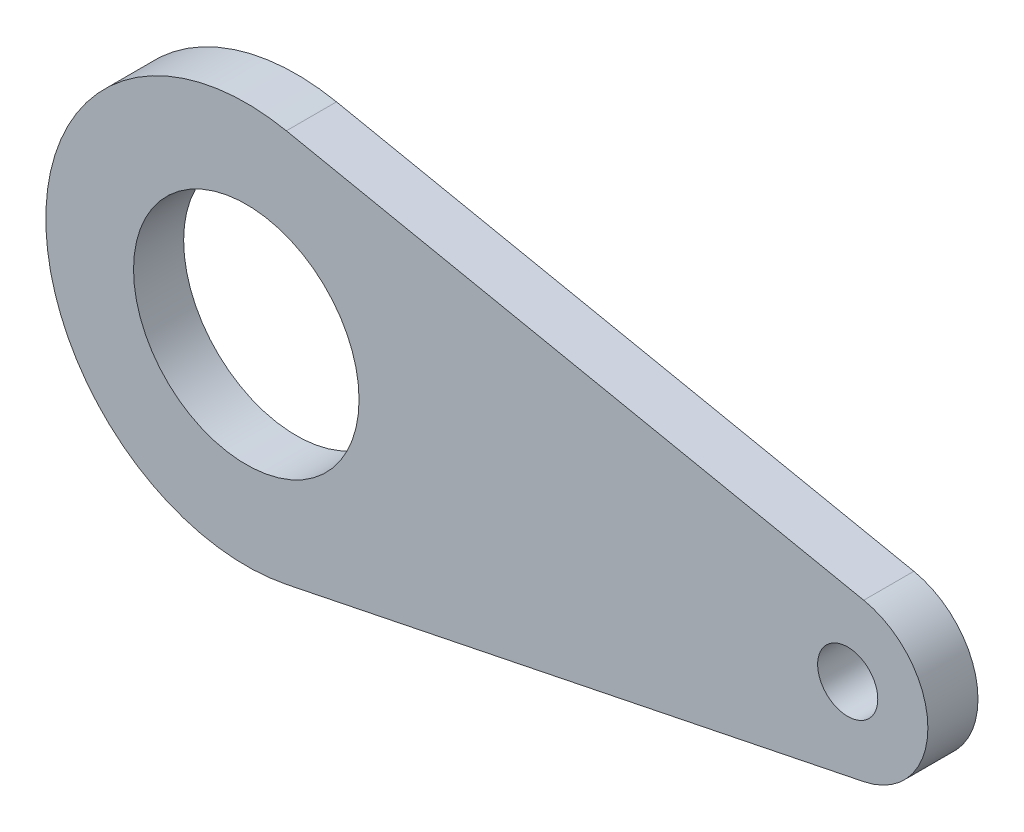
from build123d import *

# Parameters (mm, degrees)
ESQUISSE1_R          = 6
ESQUISSE1_R_2        = 22.5
BASE_EXTRUSION_DEPTH = 5


with BuildPart() as part:
    # Esquisse1 → Base-Extrusion (new, symmetric)
    with BuildSketch(Plane.XY):
        with BuildLine():
            Line((8, 39.191835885), (123.2, 15.676734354))
            ThreePointArc((123.2, 15.676734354), (136, 0), (123.2, -15.676734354))
            Line((123.2, -15.676734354), (8, -39.191835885))
            ThreePointArc((8, -39.191835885), (-40, 0), (8, 39.191835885))
        make_face()
        with Locations((120, 0)):
            Circle(ESQUISSE1_R, mode=Mode.SUBTRACT)
        Circle(ESQUISSE1_R_2, mode=Mode.SUBTRACT)
    extrude(amount=BASE_EXTRUSION_DEPTH, both=True)


solid = part.part
